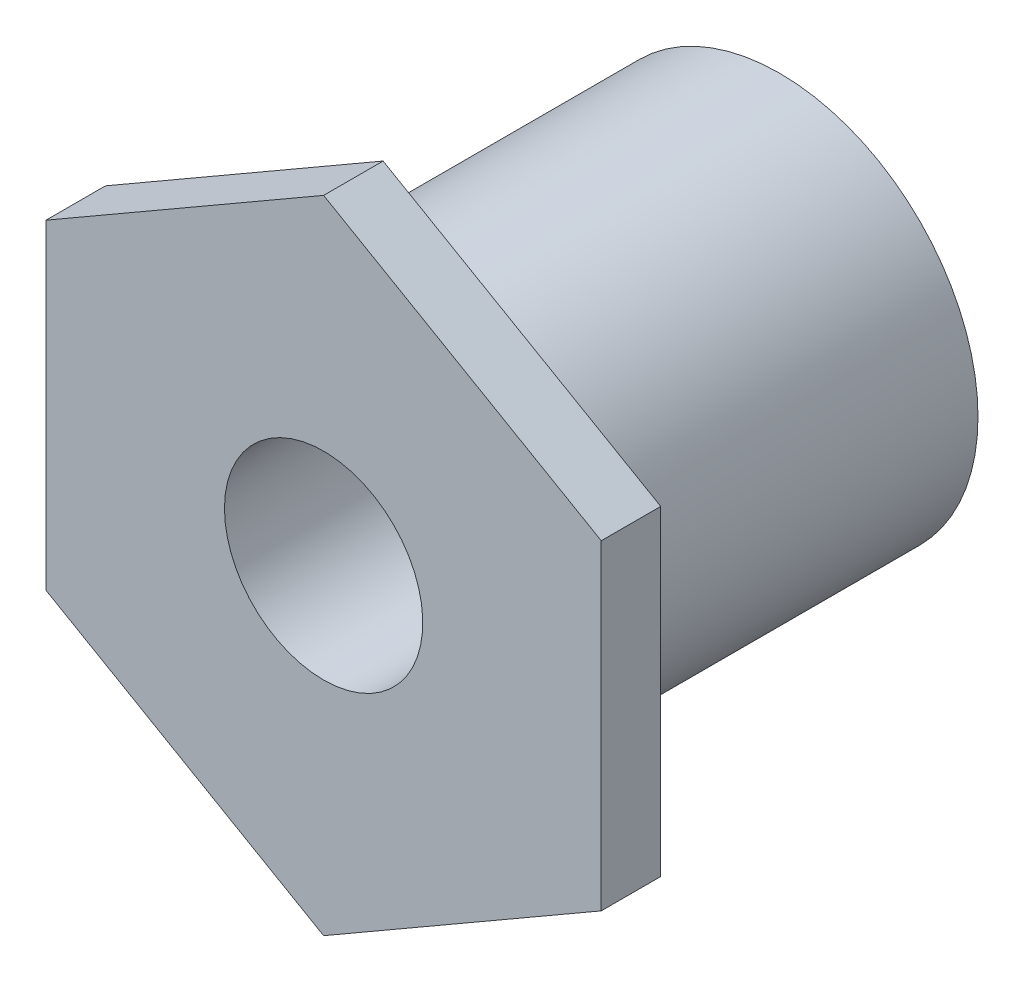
ISO-10303-21;
HEADER;
FILE_DESCRIPTION(('STEP AP214'),'2;1');
FILE_NAME('part.step','',(''),(''),'','','');
FILE_SCHEMA(('AUTOMOTIVE_DESIGN { 1 0 10303 214 1 1 1 1 }'));
ENDSEC;
DATA;
#1=APPLICATION_CONTEXT('core data for automotive mechanical design processes');
#2=APPLICATION_PROTOCOL_DEFINITION('international standard','automotive_design',2000,#1);
#3=PRODUCT_CONTEXT('',#1,'mechanical');
#4=PRODUCT('Part','Part','',(#3));
#5=PRODUCT_RELATED_PRODUCT_CATEGORY('part','',(#4));
#6=PRODUCT_DEFINITION_FORMATION('','',#4);
#7=PRODUCT_DEFINITION_CONTEXT('part definition',#1,'design');
#8=PRODUCT_DEFINITION('design','',#6,#7);
#9=PRODUCT_DEFINITION_SHAPE('','',#8);
#10=(LENGTH_UNIT() NAMED_UNIT(*) SI_UNIT(.MILLI.,.METRE.));
#11=(NAMED_UNIT(*) PLANE_ANGLE_UNIT() SI_UNIT($,.RADIAN.));
#12=(NAMED_UNIT(*) SI_UNIT($,.STERADIAN.) SOLID_ANGLE_UNIT());
#13=UNCERTAINTY_MEASURE_WITH_UNIT(LENGTH_MEASURE(1.E-05),#10,'distance_accuracy_value','');
#14=(GEOMETRIC_REPRESENTATION_CONTEXT(3) GLOBAL_UNCERTAINTY_ASSIGNED_CONTEXT((#13)) GLOBAL_UNIT_ASSIGNED_CONTEXT((#10,
#11,#12)) REPRESENTATION_CONTEXT('',''));
#15=CARTESIAN_POINT('',(0.,0.,0.));
#16=DIRECTION('',(0.,0.,1.));
#17=DIRECTION('',(1.,0.,0.));
#18=AXIS2_PLACEMENT_3D('',#15,#16,#17);
#19=CARTESIAN_POINT('',(2.5,0.,1.5));
#20=DIRECTION('',(0.,0.,1.));
#21=DIRECTION('',(0.,-1.,0.));
#22=AXIS2_PLACEMENT_3D('',#19,#20,#21);
#23=PLANE('',#22);
#24=CARTESIAN_POINT('',(0.,0.,1.5));
#25=DIRECTION('',(0.,0.,1.));
#26=DIRECTION('',(0.,-1.,0.));
#27=AXIS2_PLACEMENT_3D('',#24,#25,#26);
#28=CIRCLE('',#27,2.5);
#29=CARTESIAN_POINT('',(0.,-2.5,1.5));
#30=VERTEX_POINT('',#29);
#31=EDGE_CURVE('E80',#30,#30,#28,.T.);
#32=ORIENTED_EDGE('',*,*,#31,.F.);
#33=EDGE_LOOP('',(#32));
#34=FACE_BOUND('',#33,.T.);
#35=DIRECTION('',(0.,1.,0.));
#36=VECTOR('',#35,1.);
#37=CARTESIAN_POINT('',(-7.,4.04145188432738,1.5));
#38=LINE('',#37,#36);
#39=CARTESIAN_POINT('',(-7.,-4.04145188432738,1.5));
#40=VERTEX_POINT('',#39);
#41=CARTESIAN_POINT('',(-7.,4.04145188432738,1.5));
#42=VERTEX_POINT('',#41);
#43=EDGE_CURVE('E67',#40,#42,#38,.T.);
#44=ORIENTED_EDGE('',*,*,#43,.F.);
#45=DIRECTION('',(-0.866025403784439,0.5,0.));
#46=VECTOR('',#45,1.);
#47=CARTESIAN_POINT('',(-7.,-4.04145188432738,1.5));
#48=LINE('',#47,#46);
#49=CARTESIAN_POINT('',(0.,-8.08290376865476,1.5));
#50=VERTEX_POINT('',#49);
#51=EDGE_CURVE('E101',#50,#40,#48,.T.);
#52=ORIENTED_EDGE('',*,*,#51,.F.);
#53=DIRECTION('',(-0.866025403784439,-0.5,0.));
#54=VECTOR('',#53,1.);
#55=CARTESIAN_POINT('',(0.,-8.08290376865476,1.5));
#56=LINE('',#55,#54);
#57=CARTESIAN_POINT('',(7.,-4.04145188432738,1.5));
#58=VERTEX_POINT('',#57);
#59=EDGE_CURVE('E96',#58,#50,#56,.T.);
#60=ORIENTED_EDGE('',*,*,#59,.F.);
#61=DIRECTION('',(0.,-1.,0.));
#62=VECTOR('',#61,1.);
#63=CARTESIAN_POINT('',(7.,-4.04145188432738,1.5));
#64=LINE('',#63,#62);
#65=CARTESIAN_POINT('',(7.,4.04145188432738,1.5));
#66=VERTEX_POINT('',#65);
#67=EDGE_CURVE('E90',#66,#58,#64,.T.);
#68=ORIENTED_EDGE('',*,*,#67,.F.);
#69=DIRECTION('',(0.866025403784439,-0.5,0.));
#70=VECTOR('',#69,1.);
#71=CARTESIAN_POINT('',(7.,4.04145188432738,1.5));
#72=LINE('',#71,#70);
#73=CARTESIAN_POINT('',(0.,8.08290376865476,1.5));
#74=VERTEX_POINT('',#73);
#75=EDGE_CURVE('E63',#74,#66,#72,.T.);
#76=ORIENTED_EDGE('',*,*,#75,.F.);
#77=DIRECTION('',(0.866025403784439,0.5,0.));
#78=VECTOR('',#77,1.);
#79=CARTESIAN_POINT('',(0.,8.08290376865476,1.5));
#80=LINE('',#79,#78);
#81=EDGE_CURVE('E65',#42,#74,#80,.T.);
#82=ORIENTED_EDGE('',*,*,#81,.F.);
#83=EDGE_LOOP('',(#44,#52,#60,#68,#76,#82));
#84=FACE_BOUND('',#83,.T.);
#85=ADVANCED_FACE('F14',(#34,#84),#23,.T.);
#86=CARTESIAN_POINT('',(-7.,4.04145188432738,0.));
#87=DIRECTION('',(-1.,0.,0.));
#88=DIRECTION('',(0.,1.,0.));
#89=AXIS2_PLACEMENT_3D('',#86,#87,#88);
#90=PLANE('',#89);
#91=DIRECTION('',(0.,1.,0.));
#92=VECTOR('',#91,1.);
#93=CARTESIAN_POINT('',(-7.,0.,0.));
#94=LINE('',#93,#92);
#95=CARTESIAN_POINT('',(-7.,-4.04145188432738,0.));
#96=VERTEX_POINT('',#95);
#97=CARTESIAN_POINT('',(-7.,4.04145188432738,0.));
#98=VERTEX_POINT('',#97);
#99=EDGE_CURVE('E105',#96,#98,#94,.T.);
#100=ORIENTED_EDGE('',*,*,#99,.F.);
#101=DIRECTION('',(0.,0.,-1.));
#102=VECTOR('',#101,1.);
#103=CARTESIAN_POINT('',(-7.,-4.04145188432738,0.));
#104=LINE('',#103,#102);
#105=EDGE_CURVE('E78',#40,#96,#104,.T.);
#106=ORIENTED_EDGE('',*,*,#105,.F.);
#107=ORIENTED_EDGE('',*,*,#43,.T.);
#108=DIRECTION('',(0.,0.,-1.));
#109=VECTOR('',#108,1.);
#110=CARTESIAN_POINT('',(-7.,4.04145188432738,0.));
#111=LINE('',#110,#109);
#112=EDGE_CURVE('E72',#98,#42,#111,.F.);
#113=ORIENTED_EDGE('',*,*,#112,.F.);
#114=EDGE_LOOP('',(#100,#106,#107,#113));
#115=FACE_BOUND('',#114,.T.);
#116=ADVANCED_FACE('F75',(#115),#90,.T.);
#117=CARTESIAN_POINT('',(0.,8.08290376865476,0.));
#118=DIRECTION('',(-0.5,0.866025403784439,0.));
#119=DIRECTION('',(0.866025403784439,0.5,0.));
#120=AXIS2_PLACEMENT_3D('',#117,#118,#119);
#121=PLANE('',#120);
#122=DIRECTION('',(0.866025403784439,0.5,0.));
#123=VECTOR('',#122,1.);
#124=CARTESIAN_POINT('',(-7.,4.04145188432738,0.));
#125=LINE('',#124,#123);
#126=CARTESIAN_POINT('',(0.,8.08290376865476,0.));
#127=VERTEX_POINT('',#126);
#128=EDGE_CURVE('E83',#98,#127,#125,.T.);
#129=ORIENTED_EDGE('',*,*,#128,.F.);
#130=ORIENTED_EDGE('',*,*,#112,.T.);
#131=ORIENTED_EDGE('',*,*,#81,.T.);
#132=DIRECTION('',(0.,0.,-1.));
#133=VECTOR('',#132,1.);
#134=CARTESIAN_POINT('',(0.,8.08290376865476,0.));
#135=LINE('',#134,#133);
#136=EDGE_CURVE('E86',#127,#74,#135,.F.);
#137=ORIENTED_EDGE('',*,*,#136,.F.);
#138=EDGE_LOOP('',(#129,#130,#131,#137));
#139=FACE_BOUND('',#138,.T.);
#140=ADVANCED_FACE('F81',(#139),#121,.T.);
#141=CARTESIAN_POINT('',(7.,4.04145188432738,0.));
#142=DIRECTION('',(0.5,0.866025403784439,0.));
#143=DIRECTION('',(0.866025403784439,-0.5,0.));
#144=AXIS2_PLACEMENT_3D('',#141,#142,#143);
#145=PLANE('',#144);
#146=DIRECTION('',(0.866025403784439,-0.5,0.));
#147=VECTOR('',#146,1.);
#148=CARTESIAN_POINT('',(0.,8.08290376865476,0.));
#149=LINE('',#148,#147);
#150=CARTESIAN_POINT('',(7.,4.04145188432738,0.));
#151=VERTEX_POINT('',#150);
#152=EDGE_CURVE('E108',#127,#151,#149,.T.);
#153=ORIENTED_EDGE('',*,*,#152,.F.);
#154=ORIENTED_EDGE('',*,*,#136,.T.);
#155=ORIENTED_EDGE('',*,*,#75,.T.);
#156=DIRECTION('',(0.,0.,-1.));
#157=VECTOR('',#156,1.);
#158=CARTESIAN_POINT('',(7.,4.04145188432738,0.));
#159=LINE('',#158,#157);
#160=EDGE_CURVE('E93',#151,#66,#159,.F.);
#161=ORIENTED_EDGE('',*,*,#160,.F.);
#162=EDGE_LOOP('',(#153,#154,#155,#161));
#163=FACE_BOUND('',#162,.T.);
#164=ADVANCED_FACE('F165',(#163),#145,.T.);
#165=CARTESIAN_POINT('',(7.,-4.04145188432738,0.));
#166=DIRECTION('',(1.,0.,0.));
#167=DIRECTION('',(0.,-1.,0.));
#168=AXIS2_PLACEMENT_3D('',#165,#166,#167);
#169=PLANE('',#168);
#170=DIRECTION('',(0.,1.,0.));
#171=VECTOR('',#170,1.);
#172=CARTESIAN_POINT('',(7.,0.,0.));
#173=LINE('',#172,#171);
#174=CARTESIAN_POINT('',(7.,-4.04145188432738,0.));
#175=VERTEX_POINT('',#174);
#176=EDGE_CURVE('E111',#151,#175,#173,.F.);
#177=ORIENTED_EDGE('',*,*,#176,.F.);
#178=ORIENTED_EDGE('',*,*,#160,.T.);
#179=ORIENTED_EDGE('',*,*,#67,.T.);
#180=DIRECTION('',(0.,0.,-1.));
#181=VECTOR('',#180,1.);
#182=CARTESIAN_POINT('',(7.,-4.04145188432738,0.));
#183=LINE('',#182,#181);
#184=EDGE_CURVE('E98',#175,#58,#183,.F.);
#185=ORIENTED_EDGE('',*,*,#184,.F.);
#186=EDGE_LOOP('',(#177,#178,#179,#185));
#187=FACE_BOUND('',#186,.T.);
#188=ADVANCED_FACE('F162',(#187),#169,.T.);
#189=CARTESIAN_POINT('',(0.,-8.08290376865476,0.));
#190=DIRECTION('',(0.5,-0.866025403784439,0.));
#191=DIRECTION('',(-0.866025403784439,-0.5,0.));
#192=AXIS2_PLACEMENT_3D('',#189,#190,#191);
#193=PLANE('',#192);
#194=DIRECTION('',(-0.866025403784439,-0.5,0.));
#195=VECTOR('',#194,1.);
#196=CARTESIAN_POINT('',(7.,-4.04145188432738,0.));
#197=LINE('',#196,#195);
#198=CARTESIAN_POINT('',(0.,-8.08290376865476,0.));
#199=VERTEX_POINT('',#198);
#200=EDGE_CURVE('E114',#175,#199,#197,.T.);
#201=ORIENTED_EDGE('',*,*,#200,.F.);
#202=ORIENTED_EDGE('',*,*,#184,.T.);
#203=ORIENTED_EDGE('',*,*,#59,.T.);
#204=DIRECTION('',(0.,0.,-1.));
#205=VECTOR('',#204,1.);
#206=CARTESIAN_POINT('',(0.,-8.08290376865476,0.));
#207=LINE('',#206,#205);
#208=EDGE_CURVE('E30',#199,#50,#207,.F.);
#209=ORIENTED_EDGE('',*,*,#208,.F.);
#210=EDGE_LOOP('',(#201,#202,#203,#209));
#211=FACE_BOUND('',#210,.T.);
#212=ADVANCED_FACE('F158',(#211),#193,.T.);
#213=CARTESIAN_POINT('',(-7.,-4.04145188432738,0.));
#214=DIRECTION('',(-0.5,-0.866025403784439,0.));
#215=DIRECTION('',(-0.866025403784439,0.5,0.));
#216=AXIS2_PLACEMENT_3D('',#213,#214,#215);
#217=PLANE('',#216);
#218=DIRECTION('',(-0.866025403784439,0.5,0.));
#219=VECTOR('',#218,1.);
#220=CARTESIAN_POINT('',(0.,-8.08290376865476,0.));
#221=LINE('',#220,#219);
#222=EDGE_CURVE('E22',#199,#96,#221,.T.);
#223=ORIENTED_EDGE('',*,*,#222,.F.);
#224=ORIENTED_EDGE('',*,*,#208,.T.);
#225=ORIENTED_EDGE('',*,*,#51,.T.);
#226=ORIENTED_EDGE('',*,*,#105,.T.);
#227=EDGE_LOOP('',(#223,#224,#225,#226));
#228=FACE_BOUND('',#227,.T.);
#229=ADVANCED_FACE('F151',(#228),#217,.T.);
#230=CARTESIAN_POINT('',(12.,0.,0.));
#231=DIRECTION('',(0.,0.,-1.));
#232=DIRECTION('',(0.,1.,0.));
#233=AXIS2_PLACEMENT_3D('',#230,#231,#232);
#234=PLANE('',#233);
#235=ORIENTED_EDGE('',*,*,#200,.T.);
#236=ORIENTED_EDGE('',*,*,#222,.T.);
#237=ORIENTED_EDGE('',*,*,#99,.T.);
#238=ORIENTED_EDGE('',*,*,#128,.T.);
#239=ORIENTED_EDGE('',*,*,#152,.T.);
#240=ORIENTED_EDGE('',*,*,#176,.T.);
#241=EDGE_LOOP('',(#235,#236,#237,#238,#239,#240));
#242=FACE_BOUND('',#241,.T.);
#243=CARTESIAN_POINT('',(0.,0.,0.));
#244=DIRECTION('',(0.,0.,-1.));
#245=DIRECTION('',(0.,1.,0.));
#246=AXIS2_PLACEMENT_3D('',#243,#244,#245);
#247=CIRCLE('',#246,5.);
#248=CARTESIAN_POINT('',(0.,5.,0.));
#249=VERTEX_POINT('',#248);
#250=EDGE_CURVE('E9',#249,#249,#247,.T.);
#251=ORIENTED_EDGE('',*,*,#250,.F.);
#252=EDGE_LOOP('',(#251));
#253=FACE_BOUND('',#252,.T.);
#254=ADVANCED_FACE('F144',(#242,#253),#234,.T.);
#255=CARTESIAN_POINT('',(0.,0.,1.5));
#256=DIRECTION('',(0.,0.,-1.));
#257=DIRECTION('',(0.,1.,0.));
#258=AXIS2_PLACEMENT_3D('',#255,#256,#257);
#259=CYLINDRICAL_SURFACE('',#258,5.);
#260=ORIENTED_EDGE('',*,*,#250,.T.);
#261=EDGE_LOOP('',(#260));
#262=FACE_BOUND('',#261,.T.);
#263=CARTESIAN_POINT('',(0.,0.,-10.));
#264=DIRECTION('',(0.,0.,-1.));
#265=DIRECTION('',(-1.,0.,0.));
#266=AXIS2_PLACEMENT_3D('',#263,#264,#265);
#267=CIRCLE('',#266,5.);
#268=CARTESIAN_POINT('',(-5.,0.,-10.));
#269=VERTEX_POINT('',#268);
#270=EDGE_CURVE('E121',#269,#269,#267,.T.);
#271=ORIENTED_EDGE('',*,*,#270,.F.);
#272=EDGE_LOOP('',(#271));
#273=FACE_BOUND('',#272,.T.);
#274=ADVANCED_FACE('F140',(#262,#273),#259,.T.);
#275=CARTESIAN_POINT('',(0.,0.,5.));
#276=DIRECTION('',(0.,0.,-1.));
#277=DIRECTION('',(0.,1.,0.));
#278=AXIS2_PLACEMENT_3D('',#275,#276,#277);
#279=CYLINDRICAL_SURFACE('',#278,2.5);
#280=ORIENTED_EDGE('',*,*,#31,.T.);
#281=EDGE_LOOP('',(#280));
#282=FACE_BOUND('',#281,.T.);
#283=CARTESIAN_POINT('',(0.,0.,-10.));
#284=DIRECTION('',(0.,0.,-1.));
#285=DIRECTION('',(-1.,0.,0.));
#286=AXIS2_PLACEMENT_3D('',#283,#284,#285);
#287=CIRCLE('',#286,2.5);
#288=CARTESIAN_POINT('',(-2.5,0.,-10.));
#289=VERTEX_POINT('',#288);
#290=EDGE_CURVE('E124',#289,#289,#287,.T.);
#291=ORIENTED_EDGE('',*,*,#290,.T.);
#292=EDGE_LOOP('',(#291));
#293=FACE_BOUND('',#292,.T.);
#294=ADVANCED_FACE('F128',(#282,#293),#279,.F.);
#295=CARTESIAN_POINT('',(0.,0.,-10.));
#296=DIRECTION('',(0.,0.,-1.));
#297=DIRECTION('',(-1.,0.,0.));
#298=AXIS2_PLACEMENT_3D('',#295,#296,#297);
#299=PLANE('',#298);
#300=ORIENTED_EDGE('',*,*,#270,.T.);
#301=EDGE_LOOP('',(#300));
#302=FACE_BOUND('',#301,.T.);
#303=ORIENTED_EDGE('',*,*,#290,.F.);
#304=EDGE_LOOP('',(#303));
#305=FACE_BOUND('',#304,.T.);
#306=ADVANCED_FACE('F130',(#302,#305),#299,.T.);
#307=CLOSED_SHELL('',(#85,#116,#140,#164,#188,#212,#229,#254,#274,#294,#306));
#308=MANIFOLD_SOLID_BREP('B1',#307);
#309=ADVANCED_BREP_SHAPE_REPRESENTATION('',(#18,#308),#14);
#310=SHAPE_DEFINITION_REPRESENTATION(#9,#309);
ENDSEC;
END-ISO-10303-21;
